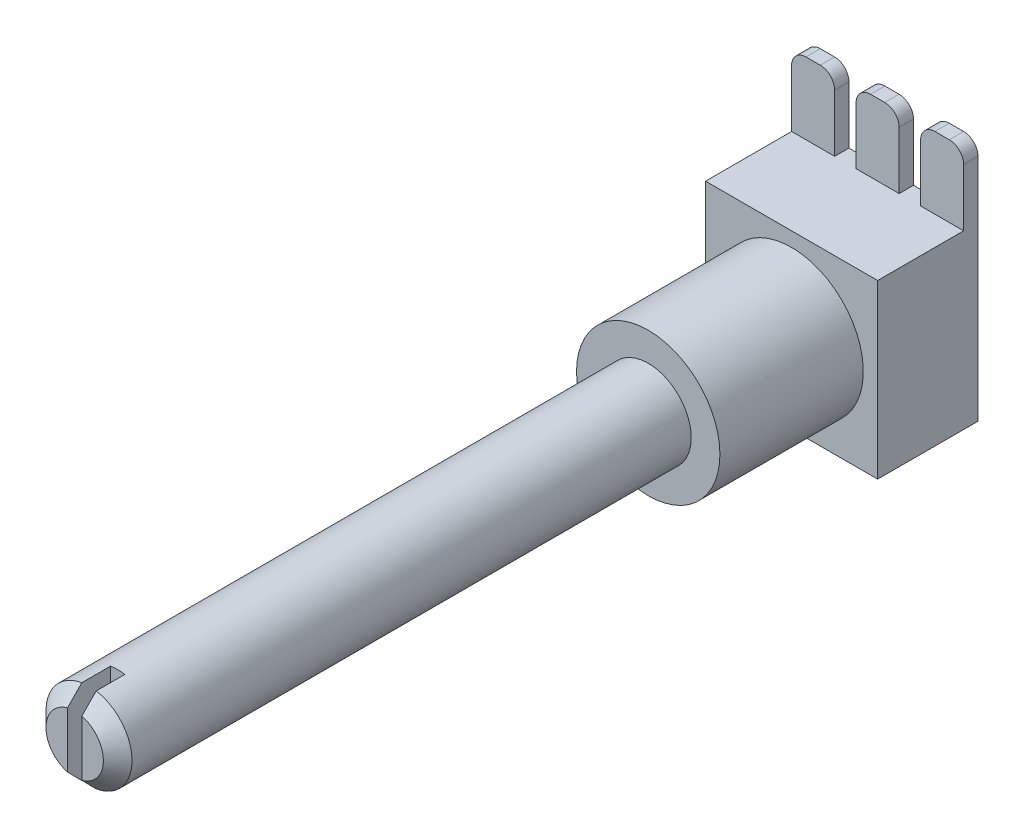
ISO-10303-21;
HEADER;
FILE_DESCRIPTION(('STEP AP214'),'2;1');
FILE_NAME('part.step','',(''),(''),'','','');
FILE_SCHEMA(('AUTOMOTIVE_DESIGN { 1 0 10303 214 1 1 1 1 }'));
ENDSEC;
DATA;
#1=APPLICATION_CONTEXT('core data for automotive mechanical design processes');
#2=APPLICATION_PROTOCOL_DEFINITION('international standard','automotive_design',2000,#1);
#3=PRODUCT_CONTEXT('',#1,'mechanical');
#4=PRODUCT('Part','Part','',(#3));
#5=PRODUCT_RELATED_PRODUCT_CATEGORY('part','',(#4));
#6=PRODUCT_DEFINITION_FORMATION('','',#4);
#7=PRODUCT_DEFINITION_CONTEXT('part definition',#1,'design');
#8=PRODUCT_DEFINITION('design','',#6,#7);
#9=PRODUCT_DEFINITION_SHAPE('','',#8);
#10=(LENGTH_UNIT() NAMED_UNIT(*) SI_UNIT(.MILLI.,.METRE.));
#11=(NAMED_UNIT(*) PLANE_ANGLE_UNIT() SI_UNIT($,.RADIAN.));
#12=(NAMED_UNIT(*) SI_UNIT($,.STERADIAN.) SOLID_ANGLE_UNIT());
#13=UNCERTAINTY_MEASURE_WITH_UNIT(LENGTH_MEASURE(1.E-05),#10,'distance_accuracy_value','');
#14=(GEOMETRIC_REPRESENTATION_CONTEXT(3) GLOBAL_UNCERTAINTY_ASSIGNED_CONTEXT((#13)) GLOBAL_UNIT_ASSIGNED_CONTEXT((#10,
#11,#12)) REPRESENTATION_CONTEXT('',''));
#15=CARTESIAN_POINT('',(0.,0.,0.));
#16=DIRECTION('',(0.,0.,1.));
#17=DIRECTION('',(1.,0.,0.));
#18=AXIS2_PLACEMENT_3D('',#15,#16,#17);
#19=CARTESIAN_POINT('',(0.,6.,57.));
#20=DIRECTION('',(0.,0.,1.));
#21=DIRECTION('',(1.,0.,0.));
#22=AXIS2_PLACEMENT_3D('',#19,#20,#21);
#23=PLANE('',#22);
#24=DIRECTION('',(0.,-1.,0.));
#25=VECTOR('',#24,1.);
#26=CARTESIAN_POINT('',(-0.500000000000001,10.318181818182,57.));
#27=LINE('',#26,#25);
#28=CARTESIAN_POINT('',(-0.5,7.93649167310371,57.));
#29=VERTEX_POINT('',#28);
#30=CARTESIAN_POINT('',(-0.5,4.06350832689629,57.));
#31=VERTEX_POINT('',#30);
#32=EDGE_CURVE('E208',#29,#31,#27,.T.);
#33=ORIENTED_EDGE('',*,*,#32,.F.);
#34=CARTESIAN_POINT('',(0.,6.,57.));
#35=DIRECTION('',(0.,0.,1.));
#36=DIRECTION('',(1.,0.,0.));
#37=AXIS2_PLACEMENT_3D('',#34,#35,#36);
#38=CIRCLE('',#37,2.);
#39=EDGE_CURVE('E221',#29,#31,#38,.T.);
#40=ORIENTED_EDGE('',*,*,#39,.T.);
#41=EDGE_LOOP('',(#33,#40));
#42=FACE_BOUND('',#41,.T.);
#43=ADVANCED_FACE('F33',(#42),#23,.T.);
#44=CARTESIAN_POINT('',(0.,6.,57.));
#45=DIRECTION('',(0.,0.,-1.));
#46=DIRECTION('',(-1.,0.,0.));
#47=AXIS2_PLACEMENT_3D('',#44,#45,#46);
#48=CONICAL_SURFACE('',#47,2.,0.785398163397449);
#49=CARTESIAN_POINT('',(-0.5,5.72789823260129,58.4307554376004));
#50=CARTESIAN_POINT('',(-0.5,5.70588010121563,58.4202095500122));
#51=CARTESIAN_POINT('',(-0.5,5.68424952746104,58.4089052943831));
#52=CARTESIAN_POINT('',(-0.5,5.64167552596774,58.3851191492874));
#53=CARTESIAN_POINT('',(-0.5,5.62073132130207,58.372638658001));
#54=CARTESIAN_POINT('',(-0.5,5.57945869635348,58.3468551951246));
#55=CARTESIAN_POINT('',(-0.5,5.55912848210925,58.3335550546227));
#56=CARTESIAN_POINT('',(-0.5,5.51890895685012,58.3062923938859));
#57=CARTESIAN_POINT('',(-0.5,5.4990197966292,58.2923296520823));
#58=CARTESIAN_POINT('',(-0.5,5.44004866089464,58.2497995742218));
#59=CARTESIAN_POINT('',(-0.5,5.40150496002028,58.2204881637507));
#60=CARTESIAN_POINT('',(-0.5,5.32535999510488,58.160600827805));
#61=CARTESIAN_POINT('',(-0.5,5.28775978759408,58.1300235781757));
#62=CARTESIAN_POINT('',(-0.5,5.21124645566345,58.0663741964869));
#63=CARTESIAN_POINT('',(-0.5,5.17237149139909,58.0332563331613));
#64=CARTESIAN_POINT('',(-0.5,5.09516775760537,57.9663886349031));
#65=CARTESIAN_POINT('',(-0.5,5.05683901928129,57.9326387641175));
#66=CARTESIAN_POINT('',(-0.5,4.94243385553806,57.8307132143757));
#67=CARTESIAN_POINT('',(-0.5,4.86695115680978,57.7618723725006));
#68=CARTESIAN_POINT('',(-0.5,4.71689717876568,57.6232110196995));
#69=CARTESIAN_POINT('',(-0.5,4.64232590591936,57.5533905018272));
#70=CARTESIAN_POINT('',(-0.5,4.49377287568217,57.4131411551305));
#71=CARTESIAN_POINT('',(-0.5,4.41979105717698,57.3427123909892));
#72=CARTESIAN_POINT('',(-0.5,4.2717266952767,57.2009810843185));
#73=CARTESIAN_POINT('',(-0.5,4.19764673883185,57.1296758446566));
#74=CARTESIAN_POINT('',(-0.5,4.04976206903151,56.9867767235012));
#75=CARTESIAN_POINT('',(-0.5,3.97595736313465,56.915182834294));
#76=CARTESIAN_POINT('',(-0.5,3.75486535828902,56.7001199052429));
#77=CARTESIAN_POINT('',(-0.5,3.60787519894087,56.5563455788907));
#78=CARTESIAN_POINT('',(-0.5,3.27994318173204,56.2345890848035));
#79=CARTESIAN_POINT('',(-0.5,3.09911864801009,56.0564875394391));
#80=CARTESIAN_POINT('',(-0.5,2.73784962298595,55.6998788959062));
#81=CARTESIAN_POINT('',(-0.5,2.55740515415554,55.5213717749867));
#82=CARTESIAN_POINT('',(-0.5,2.19842798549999,55.1657660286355));
#83=CARTESIAN_POINT('',(-0.5,2.01989304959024,54.9886696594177));
#84=CARTESIAN_POINT('',(-0.5,1.66299941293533,54.6343214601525));
#85=CARTESIAN_POINT('',(-0.5,1.48464070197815,54.457069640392));
#86=CARTESIAN_POINT('',(-0.5,1.30632807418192,54.279771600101));
#87=B_SPLINE_CURVE_WITH_KNOTS('',3,(#49,#50,#51,#52,#53,#54,#55,#56,#57,#58,#59,#60,#61,#62,#63,
#64,#65,#66,#67,#68,#69,#70,#71,#72,#73,#74,#75,#76,#77,#78,#79,#80,#81,#82,#83,#84,#85,#86),
.UNSPECIFIED.,.F.,.F.,(4,2,2,2,2,2,2,2,2,2,2,2,2,2,2,2,2,2,4),(0.,0.0731938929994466,
0.146301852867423,0.219170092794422,0.292062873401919,0.437284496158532,0.582662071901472,
0.73585902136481,0.889064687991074,1.19552591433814,1.50198931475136,1.80842051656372,
2.11688431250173,2.42535640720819,3.04219663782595,3.80361484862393,4.56507688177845,
5.31949085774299,6.07385819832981),.UNSPECIFIED.);
#88=CARTESIAN_POINT('',(-0.5,3.04196010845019,56.));
#89=VERTEX_POINT('',#88);
#90=EDGE_CURVE('E224',#31,#89,#87,.T.);
#91=ORIENTED_EDGE('',*,*,#90,.F.);
#92=ORIENTED_EDGE('',*,*,#39,.F.);
#93=CARTESIAN_POINT('',(-0.500000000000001,9.99895730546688,54.9699057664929));
#94=CARTESIAN_POINT('',(-0.500000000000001,9.84567714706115,55.121987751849));
#95=CARTESIAN_POINT('',(-0.500000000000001,9.69234258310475,55.2740151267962));
#96=CARTESIAN_POINT('',(-0.500000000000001,9.38548319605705,55.577864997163));
#97=CARTESIAN_POINT('',(-0.500000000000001,9.23195838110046,55.7296875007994));
#98=CARTESIAN_POINT('',(-0.500000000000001,8.92466179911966,56.0330076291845));
#99=CARTESIAN_POINT('',(-0.500000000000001,8.77089010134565,56.1845053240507));
#100=CARTESIAN_POINT('',(-0.500000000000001,8.46288397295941,56.4870435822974));
#101=CARTESIAN_POINT('',(-0.500000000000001,8.30864952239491,56.6380841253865));
#102=CARTESIAN_POINT('',(-0.500000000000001,8.0369745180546,56.902725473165));
#103=CARTESIAN_POINT('',(-0.5,7.91970475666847,57.0165012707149));
#104=CARTESIAN_POINT('',(-0.5,7.74322346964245,57.1865543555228));
#105=CARTESIAN_POINT('',(-0.5,7.68430342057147,57.2431339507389));
#106=CARTESIAN_POINT('',(-0.5,7.56619827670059,57.356018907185));
#107=CARTESIAN_POINT('',(-0.5,7.50701317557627,57.4123242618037));
#108=CARTESIAN_POINT('',(-0.5,7.38825988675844,57.5245717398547));
#109=CARTESIAN_POINT('',(-0.5,7.32869157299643,57.5805137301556));
#110=CARTESIAN_POINT('',(-0.5,7.20903893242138,57.6918359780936));
#111=CARTESIAN_POINT('',(-0.5,7.14895463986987,57.7472162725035));
#112=CARTESIAN_POINT('',(-0.5,7.02798787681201,57.8571462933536));
#113=CARTESIAN_POINT('',(-0.5,6.96710513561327,57.9116957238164));
#114=CARTESIAN_POINT('',(-0.5,6.87484206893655,57.9924640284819));
#115=CARTESIAN_POINT('',(-0.5,6.84392773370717,58.0192137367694));
#116=CARTESIAN_POINT('',(-0.5,6.78168014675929,58.0722263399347));
#117=CARTESIAN_POINT('',(-0.5,6.75034685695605,58.0984891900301));
#118=CARTESIAN_POINT('',(-0.5,6.71875286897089,58.1244397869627));
#119=B_SPLINE_CURVE_WITH_KNOTS('',3,(#93,#94,#95,#96,#97,#98,#99,#100,#101,#102,#103,#104,#105,
#106,#107,#108,#109,#110,#111,#112,#113,#114,#115,#116,#117,#118),.UNSPECIFIED.,.F.,.F.,(4,2,2,
2,2,2,2,2,2,2,2,2,4),(0.,0.647776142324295,1.295525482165,1.94311706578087,2.59073698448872,
3.08091200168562,3.32597340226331,3.57104068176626,3.81619318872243,4.06132954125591,
4.30655126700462,4.42918938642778,4.5518387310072),.UNSPECIFIED.);
#120=CARTESIAN_POINT('',(-0.500000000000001,8.95803989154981,56.));
#121=VERTEX_POINT('',#120);
#122=EDGE_CURVE('E204',#121,#29,#119,.T.);
#123=ORIENTED_EDGE('',*,*,#122,.F.);
#124=CARTESIAN_POINT('',(0.,6.,56.));
#125=DIRECTION('',(0.,0.,1.));
#126=DIRECTION('',(1.,0.,0.));
#127=AXIS2_PLACEMENT_3D('',#124,#125,#126);
#128=CIRCLE('',#127,3.);
#129=EDGE_CURVE('E229',#89,#121,#128,.F.);
#130=ORIENTED_EDGE('',*,*,#129,.F.);
#131=EDGE_LOOP('',(#91,#92,#123,#130));
#132=FACE_BOUND('',#131,.T.);
#133=ADVANCED_FACE('F223',(#132),#48,.T.);
#134=CARTESIAN_POINT('',(-6.,12.,7.));
#135=DIRECTION('',(0.,1.,0.));
#136=DIRECTION('',(-1.,0.,0.));
#137=AXIS2_PLACEMENT_3D('',#134,#135,#136);
#138=PLANE('',#137);
#139=DIRECTION('',(1.,0.,0.));
#140=VECTOR('',#139,1.);
#141=CARTESIAN_POINT('',(-6.,12.,0.));
#142=LINE('',#141,#140);
#143=CARTESIAN_POINT('',(-3.00000000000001,12.,0.));
#144=VERTEX_POINT('',#143);
#145=CARTESIAN_POINT('',(-1.49999999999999,12.,0.));
#146=VERTEX_POINT('',#145);
#147=EDGE_CURVE('E234',#144,#146,#142,.T.);
#148=ORIENTED_EDGE('',*,*,#147,.F.);
#149=DIRECTION('',(0.,0.,-1.));
#150=VECTOR('',#149,1.);
#151=CARTESIAN_POINT('',(-3.00000000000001,12.,1.));
#152=LINE('',#151,#150);
#153=CARTESIAN_POINT('',(-3.00000000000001,12.,1.));
#154=VERTEX_POINT('',#153);
#155=EDGE_CURVE('E315',#154,#144,#152,.T.);
#156=ORIENTED_EDGE('',*,*,#155,.F.);
#157=DIRECTION('',(-1.,0.,0.));
#158=VECTOR('',#157,1.);
#159=CARTESIAN_POINT('',(-3.00000000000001,12.,1.));
#160=LINE('',#159,#158);
#161=CARTESIAN_POINT('',(-6.,12.,1.));
#162=VERTEX_POINT('',#161);
#163=EDGE_CURVE('E312',#154,#162,#160,.T.);
#164=ORIENTED_EDGE('',*,*,#163,.T.);
#165=DIRECTION('',(0.,0.,-1.));
#166=VECTOR('',#165,1.);
#167=CARTESIAN_POINT('',(-6.,12.,7.));
#168=LINE('',#167,#166);
#169=CARTESIAN_POINT('',(-6.,12.,7.));
#170=VERTEX_POINT('',#169);
#171=EDGE_CURVE('E429',#170,#162,#168,.T.);
#172=ORIENTED_EDGE('',*,*,#171,.F.);
#173=DIRECTION('',(1.,0.,0.));
#174=VECTOR('',#173,1.);
#175=CARTESIAN_POINT('',(-6.,12.,7.));
#176=LINE('',#175,#174);
#177=CARTESIAN_POINT('',(6.,12.,7.));
#178=VERTEX_POINT('',#177);
#179=EDGE_CURVE('E426',#170,#178,#176,.T.);
#180=ORIENTED_EDGE('',*,*,#179,.T.);
#181=DIRECTION('',(0.,0.,-1.));
#182=VECTOR('',#181,1.);
#183=CARTESIAN_POINT('',(6.,12.,7.));
#184=LINE('',#183,#182);
#185=CARTESIAN_POINT('',(6.,12.,1.));
#186=VERTEX_POINT('',#185);
#187=EDGE_CURVE('E432',#178,#186,#184,.T.);
#188=ORIENTED_EDGE('',*,*,#187,.T.);
#189=DIRECTION('',(-1.,0.,0.));
#190=VECTOR('',#189,1.);
#191=CARTESIAN_POINT('',(6.,12.,1.));
#192=LINE('',#191,#190);
#193=CARTESIAN_POINT('',(3.,12.,1.));
#194=VERTEX_POINT('',#193);
#195=EDGE_CURVE('E393',#186,#194,#192,.T.);
#196=ORIENTED_EDGE('',*,*,#195,.T.);
#197=DIRECTION('',(0.,0.,-1.));
#198=VECTOR('',#197,1.);
#199=CARTESIAN_POINT('',(3.,12.,1.));
#200=LINE('',#199,#198);
#201=CARTESIAN_POINT('',(3.,12.,0.));
#202=VERTEX_POINT('',#201);
#203=EDGE_CURVE('E399',#194,#202,#200,.T.);
#204=ORIENTED_EDGE('',*,*,#203,.T.);
#205=CARTESIAN_POINT('',(1.5,12.,0.));
#206=VERTEX_POINT('',#205);
#207=EDGE_CURVE('E412',#206,#202,#142,.T.);
#208=ORIENTED_EDGE('',*,*,#207,.F.);
#209=DIRECTION('',(0.,0.,-1.));
#210=VECTOR('',#209,1.);
#211=CARTESIAN_POINT('',(1.5,12.,1.));
#212=LINE('',#211,#210);
#213=CARTESIAN_POINT('',(1.5,12.,1.));
#214=VERTEX_POINT('',#213);
#215=EDGE_CURVE('E369',#214,#206,#212,.T.);
#216=ORIENTED_EDGE('',*,*,#215,.F.);
#217=DIRECTION('',(1.,0.,0.));
#218=VECTOR('',#217,1.);
#219=CARTESIAN_POINT('',(-1.49999999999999,12.,1.));
#220=LINE('',#219,#218);
#221=CARTESIAN_POINT('',(-1.49999999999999,12.,1.));
#222=VERTEX_POINT('',#221);
#223=EDGE_CURVE('E341',#222,#214,#220,.T.);
#224=ORIENTED_EDGE('',*,*,#223,.F.);
#225=DIRECTION('',(0.,0.,-1.));
#226=VECTOR('',#225,1.);
#227=CARTESIAN_POINT('',(-1.49999999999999,12.,1.));
#228=LINE('',#227,#226);
#229=EDGE_CURVE('E357',#222,#146,#228,.T.);
#230=ORIENTED_EDGE('',*,*,#229,.T.);
#231=EDGE_LOOP('',(#148,#156,#164,#172,#180,#188,#196,#204,#208,#216,#224,#230));
#232=FACE_BOUND('',#231,.T.);
#233=ADVANCED_FACE('F449',(#232),#138,.T.);
#234=CARTESIAN_POINT('',(0.,6.,17.));
#235=DIRECTION('',(0.,0.,1.));
#236=DIRECTION('',(1.,0.,0.));
#237=AXIS2_PLACEMENT_3D('',#234,#235,#236);
#238=PLANE('',#237);
#239=CARTESIAN_POINT('',(0.,6.,17.));
#240=DIRECTION('',(0.,0.,1.));
#241=DIRECTION('',(1.,0.,0.));
#242=AXIS2_PLACEMENT_3D('',#239,#240,#241);
#243=CIRCLE('',#242,5.);
#244=CARTESIAN_POINT('',(5.,6.,17.));
#245=VERTEX_POINT('',#244);
#246=EDGE_CURVE('E471',#245,#245,#243,.T.);
#247=ORIENTED_EDGE('',*,*,#246,.T.);
#248=EDGE_LOOP('',(#247));
#249=FACE_BOUND('',#248,.T.);
#250=CARTESIAN_POINT('',(0.,6.,17.));
#251=DIRECTION('',(0.,0.,1.));
#252=DIRECTION('',(1.,0.,0.));
#253=AXIS2_PLACEMENT_3D('',#250,#251,#252);
#254=CIRCLE('',#253,3.);
#255=CARTESIAN_POINT('',(3.,6.,17.));
#256=VERTEX_POINT('',#255);
#257=EDGE_CURVE('E468',#256,#256,#254,.T.);
#258=ORIENTED_EDGE('',*,*,#257,.F.);
#259=EDGE_LOOP('',(#258));
#260=FACE_BOUND('',#259,.T.);
#261=ADVANCED_FACE('F675',(#249,#260),#238,.T.);
#262=CARTESIAN_POINT('',(-6.,0.,7.));
#263=DIRECTION('',(0.,0.,-1.));
#264=DIRECTION('',(-1.,0.,0.));
#265=AXIS2_PLACEMENT_3D('',#262,#263,#264);
#266=PLANE('',#265);
#267=DIRECTION('',(0.,-1.,0.));
#268=VECTOR('',#267,1.);
#269=CARTESIAN_POINT('',(-6.,12.,7.));
#270=LINE('',#269,#268);
#271=CARTESIAN_POINT('',(-6.,0.,7.));
#272=VERTEX_POINT('',#271);
#273=EDGE_CURVE('E418',#170,#272,#270,.T.);
#274=ORIENTED_EDGE('',*,*,#273,.T.);
#275=DIRECTION('',(-1.,0.,0.));
#276=VECTOR('',#275,1.);
#277=CARTESIAN_POINT('',(6.,0.,7.));
#278=LINE('',#277,#276);
#279=CARTESIAN_POINT('',(6.,0.,7.));
#280=VERTEX_POINT('',#279);
#281=EDGE_CURVE('E421',#280,#272,#278,.T.);
#282=ORIENTED_EDGE('',*,*,#281,.F.);
#283=DIRECTION('',(0.,1.,0.));
#284=VECTOR('',#283,1.);
#285=CARTESIAN_POINT('',(6.,0.,7.));
#286=LINE('',#285,#284);
#287=EDGE_CURVE('E424',#280,#178,#286,.T.);
#288=ORIENTED_EDGE('',*,*,#287,.T.);
#289=ORIENTED_EDGE('',*,*,#179,.F.);
#290=EDGE_LOOP('',(#274,#282,#288,#289));
#291=FACE_BOUND('',#290,.T.);
#292=CARTESIAN_POINT('',(0.,6.,7.));
#293=DIRECTION('',(0.,0.,-1.));
#294=DIRECTION('',(-1.,0.,0.));
#295=AXIS2_PLACEMENT_3D('',#292,#293,#294);
#296=CIRCLE('',#295,5.);
#297=CARTESIAN_POINT('',(-5.,6.,7.));
#298=VERTEX_POINT('',#297);
#299=EDGE_CURVE('E232',#298,#298,#296,.F.);
#300=ORIENTED_EDGE('',*,*,#299,.F.);
#301=EDGE_LOOP('',(#300));
#302=FACE_BOUND('',#301,.T.);
#303=ADVANCED_FACE('F687',(#291,#302),#266,.F.);
#304=CARTESIAN_POINT('',(-6.,12.,7.));
#305=DIRECTION('',(1.,0.,0.));
#306=DIRECTION('',(0.,1.,0.));
#307=AXIS2_PLACEMENT_3D('',#304,#305,#306);
#308=PLANE('',#307);
#309=DIRECTION('',(0.,-1.,0.));
#310=VECTOR('',#309,1.);
#311=CARTESIAN_POINT('',(-6.,12.,0.));
#312=LINE('',#311,#310);
#313=CARTESIAN_POINT('',(-6.,16.,0.));
#314=VERTEX_POINT('',#313);
#315=CARTESIAN_POINT('',(-6.,0.,0.));
#316=VERTEX_POINT('',#315);
#317=EDGE_CURVE('E474',#314,#316,#312,.T.);
#318=ORIENTED_EDGE('',*,*,#317,.T.);
#319=DIRECTION('',(0.,0.,-1.));
#320=VECTOR('',#319,1.);
#321=CARTESIAN_POINT('',(-6.,0.,7.));
#322=LINE('',#321,#320);
#323=EDGE_CURVE('E803',#272,#316,#322,.T.);
#324=ORIENTED_EDGE('',*,*,#323,.F.);
#325=ORIENTED_EDGE('',*,*,#273,.F.);
#326=ORIENTED_EDGE('',*,*,#171,.T.);
#327=DIRECTION('',(0.,-1.,0.));
#328=VECTOR('',#327,1.);
#329=CARTESIAN_POINT('',(-6.,16.,1.));
#330=LINE('',#329,#328);
#331=CARTESIAN_POINT('',(-6.,16.,1.));
#332=VERTEX_POINT('',#331);
#333=EDGE_CURVE('E310',#332,#162,#330,.T.);
#334=ORIENTED_EDGE('',*,*,#333,.F.);
#335=DIRECTION('',(0.,0.,-1.));
#336=VECTOR('',#335,1.);
#337=CARTESIAN_POINT('',(-6.,16.,1.));
#338=LINE('',#337,#336);
#339=EDGE_CURVE('E317',#332,#314,#338,.T.);
#340=ORIENTED_EDGE('',*,*,#339,.T.);
#341=EDGE_LOOP('',(#318,#324,#325,#326,#334,#340));
#342=FACE_BOUND('',#341,.T.);
#343=ADVANCED_FACE('F35',(#342),#308,.F.);
#344=CARTESIAN_POINT('',(6.,0.,7.));
#345=DIRECTION('',(0.,-1.,0.));
#346=DIRECTION('',(1.,0.,0.));
#347=AXIS2_PLACEMENT_3D('',#344,#345,#346);
#348=PLANE('',#347);
#349=DIRECTION('',(-1.,0.,0.));
#350=VECTOR('',#349,1.);
#351=CARTESIAN_POINT('',(6.,0.,0.));
#352=LINE('',#351,#350);
#353=CARTESIAN_POINT('',(6.,0.,0.));
#354=VERTEX_POINT('',#353);
#355=EDGE_CURVE('E476',#354,#316,#352,.T.);
#356=ORIENTED_EDGE('',*,*,#355,.F.);
#357=DIRECTION('',(0.,0.,-1.));
#358=VECTOR('',#357,1.);
#359=CARTESIAN_POINT('',(6.,0.,7.));
#360=LINE('',#359,#358);
#361=EDGE_CURVE('E435',#280,#354,#360,.T.);
#362=ORIENTED_EDGE('',*,*,#361,.F.);
#363=ORIENTED_EDGE('',*,*,#281,.T.);
#364=ORIENTED_EDGE('',*,*,#323,.T.);
#365=EDGE_LOOP('',(#356,#362,#363,#364));
#366=FACE_BOUND('',#365,.T.);
#367=ADVANCED_FACE('F686',(#366),#348,.T.);
#368=CARTESIAN_POINT('',(6.,0.,7.));
#369=DIRECTION('',(-1.,0.,0.));
#370=DIRECTION('',(0.,0.,1.));
#371=AXIS2_PLACEMENT_3D('',#368,#369,#370);
#372=PLANE('',#371);
#373=DIRECTION('',(0.,1.,0.));
#374=VECTOR('',#373,1.);
#375=CARTESIAN_POINT('',(6.,0.,0.));
#376=LINE('',#375,#374);
#377=CARTESIAN_POINT('',(6.,16.,0.));
#378=VERTEX_POINT('',#377);
#379=EDGE_CURVE('E413',#354,#378,#376,.T.);
#380=ORIENTED_EDGE('',*,*,#379,.T.);
#381=DIRECTION('',(0.,0.,-1.));
#382=VECTOR('',#381,1.);
#383=CARTESIAN_POINT('',(6.,16.,1.));
#384=LINE('',#383,#382);
#385=CARTESIAN_POINT('',(6.,16.,1.));
#386=VERTEX_POINT('',#385);
#387=EDGE_CURVE('E463',#386,#378,#384,.T.);
#388=ORIENTED_EDGE('',*,*,#387,.F.);
#389=DIRECTION('',(0.,1.,0.));
#390=VECTOR('',#389,1.);
#391=CARTESIAN_POINT('',(6.,12.,1.));
#392=LINE('',#391,#390);
#393=EDGE_CURVE('E385',#186,#386,#392,.T.);
#394=ORIENTED_EDGE('',*,*,#393,.F.);
#395=ORIENTED_EDGE('',*,*,#187,.F.);
#396=ORIENTED_EDGE('',*,*,#287,.F.);
#397=ORIENTED_EDGE('',*,*,#361,.T.);
#398=EDGE_LOOP('',(#380,#388,#394,#395,#396,#397));
#399=FACE_BOUND('',#398,.T.);
#400=ADVANCED_FACE('F482',(#399),#372,.F.);
#401=CARTESIAN_POINT('',(-6.,0.,0.));
#402=DIRECTION('',(0.,0.,-1.));
#403=DIRECTION('',(-1.,0.,0.));
#404=AXIS2_PLACEMENT_3D('',#401,#402,#403);
#405=PLANE('',#404);
#406=ORIENTED_EDGE('',*,*,#317,.F.);
#407=CARTESIAN_POINT('',(-5.,16.,0.));
#408=DIRECTION('',(0.,0.,-1.));
#409=DIRECTION('',(-1.,0.,0.));
#410=AXIS2_PLACEMENT_3D('',#407,#408,#409);
#411=CIRCLE('',#410,1.);
#412=CARTESIAN_POINT('',(-5.00000000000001,17.,0.));
#413=VERTEX_POINT('',#412);
#414=EDGE_CURVE('E296',#314,#413,#411,.T.);
#415=ORIENTED_EDGE('',*,*,#414,.T.);
#416=DIRECTION('',(1.,0.,0.));
#417=VECTOR('',#416,1.);
#418=CARTESIAN_POINT('',(-5.00000000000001,17.,0.));
#419=LINE('',#418,#417);
#420=CARTESIAN_POINT('',(-4.00000000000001,17.,0.));
#421=VERTEX_POINT('',#420);
#422=EDGE_CURVE('E293',#413,#421,#419,.T.);
#423=ORIENTED_EDGE('',*,*,#422,.T.);
#424=CARTESIAN_POINT('',(-4.00000000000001,16.,0.));
#425=DIRECTION('',(0.,0.,1.));
#426=DIRECTION('',(1.,0.,0.));
#427=AXIS2_PLACEMENT_3D('',#424,#425,#426);
#428=CIRCLE('',#427,1.);
#429=CARTESIAN_POINT('',(-3.00000000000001,16.,0.));
#430=VERTEX_POINT('',#429);
#431=EDGE_CURVE('E290',#430,#421,#428,.T.);
#432=ORIENTED_EDGE('',*,*,#431,.F.);
#433=DIRECTION('',(0.,1.,0.));
#434=VECTOR('',#433,1.);
#435=CARTESIAN_POINT('',(-3.00000000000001,12.,0.));
#436=LINE('',#435,#434);
#437=EDGE_CURVE('E56',#144,#430,#436,.T.);
#438=ORIENTED_EDGE('',*,*,#437,.F.);
#439=ORIENTED_EDGE('',*,*,#147,.T.);
#440=DIRECTION('',(0.,-1.,0.));
#441=VECTOR('',#440,1.);
#442=CARTESIAN_POINT('',(-1.49999999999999,16.,0.));
#443=LINE('',#442,#441);
#444=CARTESIAN_POINT('',(-1.49999999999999,16.,0.));
#445=VERTEX_POINT('',#444);
#446=EDGE_CURVE('E338',#445,#146,#443,.T.);
#447=ORIENTED_EDGE('',*,*,#446,.F.);
#448=CARTESIAN_POINT('',(-0.499999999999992,16.,0.));
#449=DIRECTION('',(0.,0.,-1.));
#450=DIRECTION('',(-1.,0.,0.));
#451=AXIS2_PLACEMENT_3D('',#448,#449,#450);
#452=CIRCLE('',#451,1.);
#453=CARTESIAN_POINT('',(-0.499999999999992,17.,0.));
#454=VERTEX_POINT('',#453);
#455=EDGE_CURVE('E335',#445,#454,#452,.T.);
#456=ORIENTED_EDGE('',*,*,#455,.T.);
#457=DIRECTION('',(1.,0.,0.));
#458=VECTOR('',#457,1.);
#459=CARTESIAN_POINT('',(-0.499999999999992,17.,0.));
#460=LINE('',#459,#458);
#461=CARTESIAN_POINT('',(0.500000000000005,17.,0.));
#462=VERTEX_POINT('',#461);
#463=EDGE_CURVE('E332',#454,#462,#460,.T.);
#464=ORIENTED_EDGE('',*,*,#463,.T.);
#465=CARTESIAN_POINT('',(0.500000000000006,16.,0.));
#466=DIRECTION('',(0.,0.,1.));
#467=DIRECTION('',(1.,0.,0.));
#468=AXIS2_PLACEMENT_3D('',#465,#466,#467);
#469=CIRCLE('',#468,1.);
#470=CARTESIAN_POINT('',(1.50000000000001,16.,0.));
#471=VERTEX_POINT('',#470);
#472=EDGE_CURVE('E329',#471,#462,#469,.T.);
#473=ORIENTED_EDGE('',*,*,#472,.F.);
#474=DIRECTION('',(0.,1.,0.));
#475=VECTOR('',#474,1.);
#476=CARTESIAN_POINT('',(1.5,12.,0.));
#477=LINE('',#476,#475);
#478=EDGE_CURVE('E327',#206,#471,#477,.T.);
#479=ORIENTED_EDGE('',*,*,#478,.F.);
#480=ORIENTED_EDGE('',*,*,#207,.T.);
#481=DIRECTION('',(0.,-1.,0.));
#482=VECTOR('',#481,1.);
#483=CARTESIAN_POINT('',(3.00000000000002,16.,0.));
#484=LINE('',#483,#482);
#485=CARTESIAN_POINT('',(3.00000000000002,16.,0.));
#486=VERTEX_POINT('',#485);
#487=EDGE_CURVE('E381',#486,#202,#484,.T.);
#488=ORIENTED_EDGE('',*,*,#487,.F.);
#489=CARTESIAN_POINT('',(4.00000000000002,16.,0.));
#490=DIRECTION('',(0.,0.,-1.));
#491=DIRECTION('',(-1.,0.,0.));
#492=AXIS2_PLACEMENT_3D('',#489,#490,#491);
#493=CIRCLE('',#492,1.);
#494=CARTESIAN_POINT('',(4.00000000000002,17.,0.));
#495=VERTEX_POINT('',#494);
#496=EDGE_CURVE('E378',#486,#495,#493,.T.);
#497=ORIENTED_EDGE('',*,*,#496,.T.);
#498=DIRECTION('',(1.,0.,0.));
#499=VECTOR('',#498,1.);
#500=CARTESIAN_POINT('',(4.00000000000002,17.,0.));
#501=LINE('',#500,#499);
#502=CARTESIAN_POINT('',(5.,17.,0.));
#503=VERTEX_POINT('',#502);
#504=EDGE_CURVE('E375',#495,#503,#501,.T.);
#505=ORIENTED_EDGE('',*,*,#504,.T.);
#506=CARTESIAN_POINT('',(5.,16.,0.));
#507=DIRECTION('',(0.,0.,1.));
#508=DIRECTION('',(1.,0.,0.));
#509=AXIS2_PLACEMENT_3D('',#506,#507,#508);
#510=CIRCLE('',#509,1.);
#511=EDGE_CURVE('E372',#378,#503,#510,.T.);
#512=ORIENTED_EDGE('',*,*,#511,.F.);
#513=ORIENTED_EDGE('',*,*,#379,.F.);
#514=ORIENTED_EDGE('',*,*,#355,.T.);
#515=EDGE_LOOP('',(#406,#415,#423,#432,#438,#439,#447,#456,#464,#473,#479,#480,#488,#497,#505,
#512,#513,#514));
#516=FACE_BOUND('',#515,.T.);
#517=ADVANCED_FACE('F484',(#516),#405,.T.);
#518=CARTESIAN_POINT('',(0.,6.,17.));
#519=DIRECTION('',(0.,0.,-1.));
#520=DIRECTION('',(-1.,0.,0.));
#521=AXIS2_PLACEMENT_3D('',#518,#519,#520);
#522=CYLINDRICAL_SURFACE('',#521,5.);
#523=ORIENTED_EDGE('',*,*,#246,.F.);
#524=EDGE_LOOP('',(#523));
#525=FACE_BOUND('',#524,.T.);
#526=ORIENTED_EDGE('',*,*,#299,.T.);
#527=EDGE_LOOP('',(#526));
#528=FACE_BOUND('',#527,.T.);
#529=ADVANCED_FACE('F510',(#525,#528),#522,.T.);
#530=CARTESIAN_POINT('',(0.,6.,57.));
#531=DIRECTION('',(0.,0.,-1.));
#532=DIRECTION('',(-1.,0.,0.));
#533=AXIS2_PLACEMENT_3D('',#530,#531,#532);
#534=CYLINDRICAL_SURFACE('',#533,3.);
#535=ORIENTED_EDGE('',*,*,#129,.T.);
#536=DIRECTION('',(0.,0.,-1.));
#537=VECTOR('',#536,1.);
#538=CARTESIAN_POINT('',(-0.500000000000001,8.95803989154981,57.));
#539=LINE('',#538,#537);
#540=CARTESIAN_POINT('',(-0.500000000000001,8.95803989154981,54.));
#541=VERTEX_POINT('',#540);
#542=EDGE_CURVE('E211',#121,#541,#539,.T.);
#543=ORIENTED_EDGE('',*,*,#542,.T.);
#544=CARTESIAN_POINT('',(0.,6.,54.));
#545=DIRECTION('',(0.,0.,1.));
#546=DIRECTION('',(1.,0.,0.));
#547=AXIS2_PLACEMENT_3D('',#544,#545,#546);
#548=CIRCLE('',#547,3.);
#549=CARTESIAN_POINT('',(0.5,8.95803989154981,54.));
#550=VERTEX_POINT('',#549);
#551=EDGE_CURVE('E11',#550,#541,#548,.T.);
#552=ORIENTED_EDGE('',*,*,#551,.F.);
#553=DIRECTION('',(0.,0.,-1.));
#554=VECTOR('',#553,1.);
#555=CARTESIAN_POINT('',(0.5,8.95803989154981,57.));
#556=LINE('',#555,#554);
#557=CARTESIAN_POINT('',(0.5,8.95803989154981,56.));
#558=VERTEX_POINT('',#557);
#559=EDGE_CURVE('E278',#550,#558,#556,.F.);
#560=ORIENTED_EDGE('',*,*,#559,.T.);
#561=CARTESIAN_POINT('',(0.5,3.04196010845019,56.));
#562=VERTEX_POINT('',#561);
#563=EDGE_CURVE('E225',#558,#562,#128,.F.);
#564=ORIENTED_EDGE('',*,*,#563,.T.);
#565=DIRECTION('',(0.,0.,-1.));
#566=VECTOR('',#565,1.);
#567=CARTESIAN_POINT('',(0.5,3.04196010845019,57.));
#568=LINE('',#567,#566);
#569=CARTESIAN_POINT('',(0.5,3.04196010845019,54.));
#570=VERTEX_POINT('',#569);
#571=EDGE_CURVE('E275',#562,#570,#568,.T.);
#572=ORIENTED_EDGE('',*,*,#571,.T.);
#573=CARTESIAN_POINT('',(-0.5,3.04196010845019,54.));
#574=VERTEX_POINT('',#573);
#575=EDGE_CURVE('E37',#574,#570,#548,.T.);
#576=ORIENTED_EDGE('',*,*,#575,.F.);
#577=DIRECTION('',(0.,0.,-1.));
#578=VECTOR('',#577,1.);
#579=CARTESIAN_POINT('',(-0.5,3.04196010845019,57.));
#580=LINE('',#579,#578);
#581=EDGE_CURVE('E284',#574,#89,#580,.F.);
#582=ORIENTED_EDGE('',*,*,#581,.T.);
#583=EDGE_LOOP('',(#535,#543,#552,#560,#564,#572,#576,#582));
#584=FACE_BOUND('',#583,.T.);
#585=ORIENTED_EDGE('',*,*,#257,.T.);
#586=EDGE_LOOP('',(#585));
#587=FACE_BOUND('',#586,.T.);
#588=ADVANCED_FACE('F280',(#584,#587),#534,.T.);
#589=DIRECTION('',(0.,1.,0.));
#590=VECTOR('',#589,1.);
#591=CARTESIAN_POINT('',(0.5,10.318181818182,57.));
#592=LINE('',#591,#590);
#593=CARTESIAN_POINT('',(0.5,4.06350832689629,57.));
#594=VERTEX_POINT('',#593);
#595=CARTESIAN_POINT('',(0.5,7.93649167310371,57.));
#596=VERTEX_POINT('',#595);
#597=EDGE_CURVE('E48',#594,#596,#592,.T.);
#598=ORIENTED_EDGE('',*,*,#597,.F.);
#599=EDGE_CURVE('E226',#594,#596,#38,.T.);
#600=ORIENTED_EDGE('',*,*,#599,.T.);
#601=EDGE_LOOP('',(#598,#600));
#602=FACE_BOUND('',#601,.T.);
#603=ADVANCED_FACE('F497',(#602),#23,.T.);
#604=CARTESIAN_POINT('',(5.,16.,1.));
#605=DIRECTION('',(0.,0.,-1.));
#606=DIRECTION('',(-1.,0.,0.));
#607=AXIS2_PLACEMENT_3D('',#604,#605,#606);
#608=CYLINDRICAL_SURFACE('',#607,1.);
#609=ORIENTED_EDGE('',*,*,#511,.T.);
#610=DIRECTION('',(0.,0.,-1.));
#611=VECTOR('',#610,1.);
#612=CARTESIAN_POINT('',(5.,17.,1.));
#613=LINE('',#612,#611);
#614=CARTESIAN_POINT('',(5.,17.,1.));
#615=VERTEX_POINT('',#614);
#616=EDGE_CURVE('E462',#615,#503,#613,.T.);
#617=ORIENTED_EDGE('',*,*,#616,.F.);
#618=CARTESIAN_POINT('',(5.,16.,1.));
#619=DIRECTION('',(0.,0.,1.));
#620=DIRECTION('',(1.,0.,0.));
#621=AXIS2_PLACEMENT_3D('',#618,#619,#620);
#622=CIRCLE('',#621,1.);
#623=EDGE_CURVE('E382',#386,#615,#622,.T.);
#624=ORIENTED_EDGE('',*,*,#623,.F.);
#625=ORIENTED_EDGE('',*,*,#387,.T.);
#626=EDGE_LOOP('',(#609,#617,#624,#625));
#627=FACE_BOUND('',#626,.T.);
#628=ADVANCED_FACE('F487',(#627),#608,.T.);
#629=CARTESIAN_POINT('',(4.00000000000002,17.,1.));
#630=DIRECTION('',(0.,1.,0.));
#631=DIRECTION('',(0.,0.,1.));
#632=AXIS2_PLACEMENT_3D('',#629,#630,#631);
#633=PLANE('',#632);
#634=ORIENTED_EDGE('',*,*,#504,.F.);
#635=DIRECTION('',(0.,0.,-1.));
#636=VECTOR('',#635,1.);
#637=CARTESIAN_POINT('',(4.00000000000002,17.,1.));
#638=LINE('',#637,#636);
#639=CARTESIAN_POINT('',(4.00000000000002,17.,1.));
#640=VERTEX_POINT('',#639);
#641=EDGE_CURVE('E460',#640,#495,#638,.T.);
#642=ORIENTED_EDGE('',*,*,#641,.F.);
#643=DIRECTION('',(1.,0.,0.));
#644=VECTOR('',#643,1.);
#645=CARTESIAN_POINT('',(4.00000000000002,17.,1.));
#646=LINE('',#645,#644);
#647=EDGE_CURVE('E384',#640,#615,#646,.T.);
#648=ORIENTED_EDGE('',*,*,#647,.T.);
#649=ORIENTED_EDGE('',*,*,#616,.T.);
#650=EDGE_LOOP('',(#634,#642,#648,#649));
#651=FACE_BOUND('',#650,.T.);
#652=ADVANCED_FACE('F489',(#651),#633,.T.);
#653=CARTESIAN_POINT('',(4.00000000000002,16.,1.));
#654=DIRECTION('',(0.,0.,-1.));
#655=DIRECTION('',(-1.,0.,0.));
#656=AXIS2_PLACEMENT_3D('',#653,#654,#655);
#657=CYLINDRICAL_SURFACE('',#656,1.);
#658=ORIENTED_EDGE('',*,*,#496,.F.);
#659=DIRECTION('',(0.,0.,-1.));
#660=VECTOR('',#659,1.);
#661=CARTESIAN_POINT('',(3.00000000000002,16.,1.));
#662=LINE('',#661,#660);
#663=CARTESIAN_POINT('',(3.00000000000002,16.,1.));
#664=VERTEX_POINT('',#663);
#665=EDGE_CURVE('E396',#664,#486,#662,.T.);
#666=ORIENTED_EDGE('',*,*,#665,.F.);
#667=CARTESIAN_POINT('',(4.00000000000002,16.,1.));
#668=DIRECTION('',(0.,0.,-1.));
#669=DIRECTION('',(-1.,0.,0.));
#670=AXIS2_PLACEMENT_3D('',#667,#668,#669);
#671=CIRCLE('',#670,1.);
#672=EDGE_CURVE('E388',#664,#640,#671,.T.);
#673=ORIENTED_EDGE('',*,*,#672,.T.);
#674=ORIENTED_EDGE('',*,*,#641,.T.);
#675=EDGE_LOOP('',(#658,#666,#673,#674));
#676=FACE_BOUND('',#675,.T.);
#677=ADVANCED_FACE('F459',(#676),#657,.T.);
#678=CARTESIAN_POINT('',(3.00000000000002,16.,1.));
#679=DIRECTION('',(1.,0.,0.));
#680=DIRECTION('',(0.,1.,0.));
#681=AXIS2_PLACEMENT_3D('',#678,#679,#680);
#682=PLANE('',#681);
#683=ORIENTED_EDGE('',*,*,#487,.T.);
#684=ORIENTED_EDGE('',*,*,#203,.F.);
#685=DIRECTION('',(0.,-1.,0.));
#686=VECTOR('',#685,1.);
#687=CARTESIAN_POINT('',(3.00000000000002,16.,1.));
#688=LINE('',#687,#686);
#689=EDGE_CURVE('E391',#664,#194,#688,.T.);
#690=ORIENTED_EDGE('',*,*,#689,.F.);
#691=ORIENTED_EDGE('',*,*,#665,.T.);
#692=EDGE_LOOP('',(#683,#684,#690,#691));
#693=FACE_BOUND('',#692,.T.);
#694=ADVANCED_FACE('F444',(#693),#682,.F.);
#695=CARTESIAN_POINT('',(5.,16.,1.));
#696=DIRECTION('',(0.,0.,1.));
#697=DIRECTION('',(1.,0.,0.));
#698=AXIS2_PLACEMENT_3D('',#695,#696,#697);
#699=PLANE('',#698);
#700=ORIENTED_EDGE('',*,*,#393,.T.);
#701=ORIENTED_EDGE('',*,*,#623,.T.);
#702=ORIENTED_EDGE('',*,*,#647,.F.);
#703=ORIENTED_EDGE('',*,*,#672,.F.);
#704=ORIENTED_EDGE('',*,*,#689,.T.);
#705=ORIENTED_EDGE('',*,*,#195,.F.);
#706=EDGE_LOOP('',(#700,#701,#702,#703,#704,#705));
#707=FACE_BOUND('',#706,.T.);
#708=ADVANCED_FACE('F454',(#707),#699,.T.);
#709=CARTESIAN_POINT('',(1.5,12.,1.));
#710=DIRECTION('',(-1.,0.,0.));
#711=DIRECTION('',(0.,-1.,0.));
#712=AXIS2_PLACEMENT_3D('',#709,#710,#711);
#713=PLANE('',#712);
#714=ORIENTED_EDGE('',*,*,#478,.T.);
#715=DIRECTION('',(0.,0.,-1.));
#716=VECTOR('',#715,1.);
#717=CARTESIAN_POINT('',(1.50000000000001,16.,1.));
#718=LINE('',#717,#716);
#719=CARTESIAN_POINT('',(1.50000000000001,16.,1.));
#720=VERTEX_POINT('',#719);
#721=EDGE_CURVE('E366',#720,#471,#718,.T.);
#722=ORIENTED_EDGE('',*,*,#721,.F.);
#723=DIRECTION('',(0.,1.,0.));
#724=VECTOR('',#723,1.);
#725=CARTESIAN_POINT('',(1.5,12.,1.));
#726=LINE('',#725,#724);
#727=EDGE_CURVE('E344',#214,#720,#726,.T.);
#728=ORIENTED_EDGE('',*,*,#727,.F.);
#729=ORIENTED_EDGE('',*,*,#215,.T.);
#730=EDGE_LOOP('',(#714,#722,#728,#729));
#731=FACE_BOUND('',#730,.T.);
#732=ADVANCED_FACE('F560',(#731),#713,.F.);
#733=CARTESIAN_POINT('',(0.500000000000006,16.,1.));
#734=DIRECTION('',(0.,0.,-1.));
#735=DIRECTION('',(-1.,0.,0.));
#736=AXIS2_PLACEMENT_3D('',#733,#734,#735);
#737=CYLINDRICAL_SURFACE('',#736,1.);
#738=ORIENTED_EDGE('',*,*,#472,.T.);
#739=DIRECTION('',(0.,0.,-1.));
#740=VECTOR('',#739,1.);
#741=CARTESIAN_POINT('',(0.500000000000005,17.,1.));
#742=LINE('',#741,#740);
#743=CARTESIAN_POINT('',(0.500000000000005,17.,1.));
#744=VERTEX_POINT('',#743);
#745=EDGE_CURVE('E364',#744,#462,#742,.T.);
#746=ORIENTED_EDGE('',*,*,#745,.F.);
#747=CARTESIAN_POINT('',(0.500000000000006,16.,1.));
#748=DIRECTION('',(0.,0.,1.));
#749=DIRECTION('',(1.,0.,0.));
#750=AXIS2_PLACEMENT_3D('',#747,#748,#749);
#751=CIRCLE('',#750,1.);
#752=EDGE_CURVE('E346',#720,#744,#751,.T.);
#753=ORIENTED_EDGE('',*,*,#752,.F.);
#754=ORIENTED_EDGE('',*,*,#721,.T.);
#755=EDGE_LOOP('',(#738,#746,#753,#754));
#756=FACE_BOUND('',#755,.T.);
#757=ADVANCED_FACE('F556',(#756),#737,.T.);
#758=CARTESIAN_POINT('',(-0.499999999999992,17.,1.));
#759=DIRECTION('',(0.,1.,0.));
#760=DIRECTION('',(0.,0.,1.));
#761=AXIS2_PLACEMENT_3D('',#758,#759,#760);
#762=PLANE('',#761);
#763=ORIENTED_EDGE('',*,*,#463,.F.);
#764=DIRECTION('',(0.,0.,-1.));
#765=VECTOR('',#764,1.);
#766=CARTESIAN_POINT('',(-0.499999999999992,17.,1.));
#767=LINE('',#766,#765);
#768=CARTESIAN_POINT('',(-0.499999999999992,17.,1.));
#769=VERTEX_POINT('',#768);
#770=EDGE_CURVE('E362',#769,#454,#767,.T.);
#771=ORIENTED_EDGE('',*,*,#770,.F.);
#772=DIRECTION('',(1.,0.,0.));
#773=VECTOR('',#772,1.);
#774=CARTESIAN_POINT('',(-0.499999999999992,17.,1.));
#775=LINE('',#774,#773);
#776=EDGE_CURVE('E348',#769,#744,#775,.T.);
#777=ORIENTED_EDGE('',*,*,#776,.T.);
#778=ORIENTED_EDGE('',*,*,#745,.T.);
#779=EDGE_LOOP('',(#763,#771,#777,#778));
#780=FACE_BOUND('',#779,.T.);
#781=ADVANCED_FACE('F552',(#780),#762,.T.);
#782=CARTESIAN_POINT('',(-0.499999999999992,16.,1.));
#783=DIRECTION('',(0.,0.,-1.));
#784=DIRECTION('',(-1.,0.,0.));
#785=AXIS2_PLACEMENT_3D('',#782,#783,#784);
#786=CYLINDRICAL_SURFACE('',#785,1.);
#787=ORIENTED_EDGE('',*,*,#455,.F.);
#788=DIRECTION('',(0.,0.,-1.));
#789=VECTOR('',#788,1.);
#790=CARTESIAN_POINT('',(-1.49999999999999,16.,1.));
#791=LINE('',#790,#789);
#792=CARTESIAN_POINT('',(-1.49999999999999,16.,1.));
#793=VERTEX_POINT('',#792);
#794=EDGE_CURVE('E360',#793,#445,#791,.T.);
#795=ORIENTED_EDGE('',*,*,#794,.F.);
#796=CARTESIAN_POINT('',(-0.499999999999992,16.,1.));
#797=DIRECTION('',(0.,0.,-1.));
#798=DIRECTION('',(-1.,0.,0.));
#799=AXIS2_PLACEMENT_3D('',#796,#797,#798);
#800=CIRCLE('',#799,1.);
#801=EDGE_CURVE('E351',#793,#769,#800,.T.);
#802=ORIENTED_EDGE('',*,*,#801,.T.);
#803=ORIENTED_EDGE('',*,*,#770,.T.);
#804=EDGE_LOOP('',(#787,#795,#802,#803));
#805=FACE_BOUND('',#804,.T.);
#806=ADVANCED_FACE('F548',(#805),#786,.T.);
#807=CARTESIAN_POINT('',(-1.49999999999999,16.,1.));
#808=DIRECTION('',(1.,0.,0.));
#809=DIRECTION('',(0.,1.,0.));
#810=AXIS2_PLACEMENT_3D('',#807,#808,#809);
#811=PLANE('',#810);
#812=ORIENTED_EDGE('',*,*,#446,.T.);
#813=ORIENTED_EDGE('',*,*,#229,.F.);
#814=DIRECTION('',(0.,-1.,0.));
#815=VECTOR('',#814,1.);
#816=CARTESIAN_POINT('',(-1.49999999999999,16.,1.));
#817=LINE('',#816,#815);
#818=EDGE_CURVE('E354',#793,#222,#817,.T.);
#819=ORIENTED_EDGE('',*,*,#818,.F.);
#820=ORIENTED_EDGE('',*,*,#794,.T.);
#821=EDGE_LOOP('',(#812,#813,#819,#820));
#822=FACE_BOUND('',#821,.T.);
#823=ADVANCED_FACE('F544',(#822),#811,.F.);
#824=CARTESIAN_POINT('',(0.500000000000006,16.,1.));
#825=DIRECTION('',(0.,0.,1.));
#826=DIRECTION('',(1.,0.,0.));
#827=AXIS2_PLACEMENT_3D('',#824,#825,#826);
#828=PLANE('',#827);
#829=ORIENTED_EDGE('',*,*,#223,.T.);
#830=ORIENTED_EDGE('',*,*,#727,.T.);
#831=ORIENTED_EDGE('',*,*,#752,.T.);
#832=ORIENTED_EDGE('',*,*,#776,.F.);
#833=ORIENTED_EDGE('',*,*,#801,.F.);
#834=ORIENTED_EDGE('',*,*,#818,.T.);
#835=EDGE_LOOP('',(#829,#830,#831,#832,#833,#834));
#836=FACE_BOUND('',#835,.T.);
#837=ADVANCED_FACE('F540',(#836),#828,.T.);
#838=CARTESIAN_POINT('',(-3.00000000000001,12.,1.));
#839=DIRECTION('',(-1.,0.,0.));
#840=DIRECTION('',(0.,-1.,0.));
#841=AXIS2_PLACEMENT_3D('',#838,#839,#840);
#842=PLANE('',#841);
#843=ORIENTED_EDGE('',*,*,#437,.T.);
#844=DIRECTION('',(0.,0.,-1.));
#845=VECTOR('',#844,1.);
#846=CARTESIAN_POINT('',(-3.00000000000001,16.,1.));
#847=LINE('',#846,#845);
#848=CARTESIAN_POINT('',(-3.00000000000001,16.,1.));
#849=VERTEX_POINT('',#848);
#850=EDGE_CURVE('E324',#849,#430,#847,.T.);
#851=ORIENTED_EDGE('',*,*,#850,.F.);
#852=DIRECTION('',(0.,1.,0.));
#853=VECTOR('',#852,1.);
#854=CARTESIAN_POINT('',(-3.00000000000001,12.,1.));
#855=LINE('',#854,#853);
#856=EDGE_CURVE('E299',#154,#849,#855,.T.);
#857=ORIENTED_EDGE('',*,*,#856,.F.);
#858=ORIENTED_EDGE('',*,*,#155,.T.);
#859=EDGE_LOOP('',(#843,#851,#857,#858));
#860=FACE_BOUND('',#859,.T.);
#861=ADVANCED_FACE('F536',(#860),#842,.F.);
#862=CARTESIAN_POINT('',(-4.00000000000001,16.,1.));
#863=DIRECTION('',(0.,0.,-1.));
#864=DIRECTION('',(-1.,0.,0.));
#865=AXIS2_PLACEMENT_3D('',#862,#863,#864);
#866=CYLINDRICAL_SURFACE('',#865,1.);
#867=ORIENTED_EDGE('',*,*,#431,.T.);
#868=DIRECTION('',(0.,0.,-1.));
#869=VECTOR('',#868,1.);
#870=CARTESIAN_POINT('',(-4.00000000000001,17.,1.));
#871=LINE('',#870,#869);
#872=CARTESIAN_POINT('',(-4.00000000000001,17.,1.));
#873=VERTEX_POINT('',#872);
#874=EDGE_CURVE('E322',#873,#421,#871,.T.);
#875=ORIENTED_EDGE('',*,*,#874,.F.);
#876=CARTESIAN_POINT('',(-4.00000000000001,16.,1.));
#877=DIRECTION('',(0.,0.,1.));
#878=DIRECTION('',(1.,0.,0.));
#879=AXIS2_PLACEMENT_3D('',#876,#877,#878);
#880=CIRCLE('',#879,1.);
#881=EDGE_CURVE('E302',#849,#873,#880,.T.);
#882=ORIENTED_EDGE('',*,*,#881,.F.);
#883=ORIENTED_EDGE('',*,*,#850,.T.);
#884=EDGE_LOOP('',(#867,#875,#882,#883));
#885=FACE_BOUND('',#884,.T.);
#886=ADVANCED_FACE('F532',(#885),#866,.T.);
#887=CARTESIAN_POINT('',(-5.00000000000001,17.,1.));
#888=DIRECTION('',(0.,1.,0.));
#889=DIRECTION('',(0.,0.,1.));
#890=AXIS2_PLACEMENT_3D('',#887,#888,#889);
#891=PLANE('',#890);
#892=ORIENTED_EDGE('',*,*,#422,.F.);
#893=DIRECTION('',(0.,0.,-1.));
#894=VECTOR('',#893,1.);
#895=CARTESIAN_POINT('',(-5.00000000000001,17.,1.));
#896=LINE('',#895,#894);
#897=CARTESIAN_POINT('',(-5.00000000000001,17.,1.));
#898=VERTEX_POINT('',#897);
#899=EDGE_CURVE('E320',#898,#413,#896,.T.);
#900=ORIENTED_EDGE('',*,*,#899,.F.);
#901=DIRECTION('',(1.,0.,0.));
#902=VECTOR('',#901,1.);
#903=CARTESIAN_POINT('',(-5.00000000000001,17.,1.));
#904=LINE('',#903,#902);
#905=EDGE_CURVE('E304',#898,#873,#904,.T.);
#906=ORIENTED_EDGE('',*,*,#905,.T.);
#907=ORIENTED_EDGE('',*,*,#874,.T.);
#908=EDGE_LOOP('',(#892,#900,#906,#907));
#909=FACE_BOUND('',#908,.T.);
#910=ADVANCED_FACE('F526',(#909),#891,.T.);
#911=CARTESIAN_POINT('',(-5.,16.,1.));
#912=DIRECTION('',(0.,0.,-1.));
#913=DIRECTION('',(-1.,0.,0.));
#914=AXIS2_PLACEMENT_3D('',#911,#912,#913);
#915=CYLINDRICAL_SURFACE('',#914,1.);
#916=ORIENTED_EDGE('',*,*,#414,.F.);
#917=ORIENTED_EDGE('',*,*,#339,.F.);
#918=CARTESIAN_POINT('',(-5.,16.,1.));
#919=DIRECTION('',(0.,0.,-1.));
#920=DIRECTION('',(-1.,0.,0.));
#921=AXIS2_PLACEMENT_3D('',#918,#919,#920);
#922=CIRCLE('',#921,1.);
#923=EDGE_CURVE('E307',#332,#898,#922,.T.);
#924=ORIENTED_EDGE('',*,*,#923,.T.);
#925=ORIENTED_EDGE('',*,*,#899,.T.);
#926=EDGE_LOOP('',(#916,#917,#924,#925));
#927=FACE_BOUND('',#926,.T.);
#928=ADVANCED_FACE('F521',(#927),#915,.T.);
#929=CARTESIAN_POINT('',(-4.00000000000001,16.,1.));
#930=DIRECTION('',(0.,0.,1.));
#931=DIRECTION('',(1.,0.,0.));
#932=AXIS2_PLACEMENT_3D('',#929,#930,#931);
#933=PLANE('',#932);
#934=ORIENTED_EDGE('',*,*,#856,.T.);
#935=ORIENTED_EDGE('',*,*,#881,.T.);
#936=ORIENTED_EDGE('',*,*,#905,.F.);
#937=ORIENTED_EDGE('',*,*,#923,.F.);
#938=ORIENTED_EDGE('',*,*,#333,.T.);
#939=ORIENTED_EDGE('',*,*,#163,.F.);
#940=EDGE_LOOP('',(#934,#935,#936,#937,#938,#939));
#941=FACE_BOUND('',#940,.T.);
#942=ADVANCED_FACE('F516',(#941),#933,.T.);
#943=CARTESIAN_POINT('',(0.5,1.30632807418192,54.279771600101));
#944=CARTESIAN_POINT('',(0.500000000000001,1.48556516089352,54.4579893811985));
#945=CARTESIAN_POINT('',(0.5,1.66484922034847,54.6361600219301));
#946=CARTESIAN_POINT('',(0.5,2.02353873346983,54.9922872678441));
#947=CARTESIAN_POINT('',(0.5,2.20294414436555,55.1702439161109));
#948=CARTESIAN_POINT('',(0.5,2.56186957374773,55.5257900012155));
#949=CARTESIAN_POINT('',(0.5,2.74138942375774,55.7033796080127));
#950=CARTESIAN_POINT('',(0.5,3.01098445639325,55.9694869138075));
#951=CARTESIAN_POINT('',(0.5,3.10091259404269,56.0581535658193));
#952=CARTESIAN_POINT('',(0.5,3.28090118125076,56.2353574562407));
#953=CARTESIAN_POINT('',(0.5,3.37096163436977,56.3238946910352));
#954=CARTESIAN_POINT('',(0.5,3.55138792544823,56.5009208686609));
#955=CARTESIAN_POINT('',(0.5,3.64175401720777,56.5894095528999));
#956=CARTESIAN_POINT('',(0.5,3.82271900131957,56.766130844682));
#957=CARTESIAN_POINT('',(0.5,3.91331786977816,56.8543634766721));
#958=CARTESIAN_POINT('',(0.5,4.09479553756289,57.0304015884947));
#959=CARTESIAN_POINT('',(0.5,4.18567407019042,57.1182073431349));
#960=CARTESIAN_POINT('',(0.5,4.36798823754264,57.29330502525));
#961=CARTESIAN_POINT('',(0.5,4.45942405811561,57.3805967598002));
#962=CARTESIAN_POINT('',(0.5,4.59734630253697,57.5109681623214));
#963=CARTESIAN_POINT('',(0.5,4.64351054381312,57.554388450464));
#964=CARTESIAN_POINT('',(0.5,4.73612341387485,57.6409158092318));
#965=CARTESIAN_POINT('',(0.5,4.78257201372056,57.6840229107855));
#966=CARTESIAN_POINT('',(0.5,4.87580455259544,57.7697641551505));
#967=CARTESIAN_POINT('',(0.5,4.92258803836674,57.8123987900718));
#968=CARTESIAN_POINT('',(0.5,5.01671470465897,57.8970831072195));
#969=CARTESIAN_POINT('',(0.5,5.06405808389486,57.9391325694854));
#970=CARTESIAN_POINT('',(0.5,5.15972991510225,58.0225031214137));
#971=CARTESIAN_POINT('',(0.5,5.20806163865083,58.0638204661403));
#972=CARTESIAN_POINT('',(0.5,5.3058782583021,58.1449858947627));
#973=CARTESIAN_POINT('',(0.5,5.3553619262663,58.1848354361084));
#974=CARTESIAN_POINT('',(0.5,5.43115679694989,58.2428204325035));
#975=CARTESIAN_POINT('',(0.5,5.45674657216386,58.2618941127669));
#976=CARTESIAN_POINT('',(0.5,5.50855215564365,58.2991455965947));
#977=CARTESIAN_POINT('',(0.5,5.53476763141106,58.3173238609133));
#978=CARTESIAN_POINT('',(0.5,5.5881219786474,58.3525172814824));
#979=CARTESIAN_POINT('',(0.5,5.61526385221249,58.3695279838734));
#980=CARTESIAN_POINT('',(0.5,5.67067946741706,58.4017014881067));
#981=CARTESIAN_POINT('',(0.5,5.69895519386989,58.4168608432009));
#982=CARTESIAN_POINT('',(0.5,5.72789823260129,58.4307554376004));
#983=B_SPLINE_CURVE_WITH_KNOTS('',3,(#943,#944,#945,#946,#947,#948,#949,#950,#951,#952,#953,
#954,#955,#956,#957,#958,#959,#960,#961,#962,#963,#964,#965,#966,#967,#968,#969,#970,#971,#972,
#973,#974,#975,#976,#977,#978,#979,#980,#981,#982),.UNSPECIFIED.,.F.,.F.,(4,2,2,2,2,2,2,2,2,2,2,
2,2,2,2,2,2,2,2,4),(0.,0.758279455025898,1.51636498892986,2.27391915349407,2.65278526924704,
3.03166177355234,3.41109064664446,3.79048201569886,4.16958357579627,4.54881935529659,
4.73894498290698,4.92905157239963,5.1189368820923,5.3088917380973,5.4996345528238,
5.69018256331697,5.78591677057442,5.88160118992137,5.97763237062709,6.07383969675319),.UNSPECIFIED.);
#984=EDGE_CURVE('E216',#562,#594,#983,.T.);
#985=ORIENTED_EDGE('',*,*,#984,.F.);
#986=ORIENTED_EDGE('',*,*,#563,.F.);
#987=CARTESIAN_POINT('',(0.5,6.71875286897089,58.1244397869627));
#988=CARTESIAN_POINT('',(0.5,6.75183642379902,58.0972616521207));
#989=CARTESIAN_POINT('',(0.5,6.78463692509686,58.0697445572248));
#990=CARTESIAN_POINT('',(0.5,6.84978380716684,58.0141836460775));
#991=CARTESIAN_POINT('',(0.5,6.88213023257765,57.9861398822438));
#992=CARTESIAN_POINT('',(0.5,6.94647992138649,57.9296780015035));
#993=CARTESIAN_POINT('',(0.5,6.97848326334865,57.9012599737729));
#994=CARTESIAN_POINT('',(0.5,7.04222710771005,57.8441291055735));
#995=CARTESIAN_POINT('',(0.5,7.07396760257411,57.8154162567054));
#996=CARTESIAN_POINT('',(0.5,7.16885613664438,57.7289607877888));
#997=CARTESIAN_POINT('',(0.5,7.2316955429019,57.6708797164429));
#998=CARTESIAN_POINT('',(0.5,7.35684066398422,57.5541392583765));
#999=CARTESIAN_POINT('',(0.5,7.41914634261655,57.4954798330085));
#1000=CARTESIAN_POINT('',(0.5,7.53776246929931,57.3830931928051));
#1001=CARTESIAN_POINT('',(0.5,7.59410520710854,57.329400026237));
#1002=CARTESIAN_POINT('',(0.5,7.70655988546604,57.2217755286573));
#1003=CARTESIAN_POINT('',(0.5,7.76267183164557,57.1678442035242));
#1004=CARTESIAN_POINT('',(0.5,7.93076928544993,57.0057633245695));
#1005=CARTESIAN_POINT('',(0.5,8.04249640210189,56.8973459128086));
#1006=CARTESIAN_POINT('',(0.5,8.30870581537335,56.6380301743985));
#1007=CARTESIAN_POINT('',(0.5,8.46299557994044,56.4869345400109));
#1008=CARTESIAN_POINT('',(0.5,8.77111940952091,56.1842795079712));
#1009=CARTESIAN_POINT('',(0.5,8.9249534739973,56.032720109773));
#1010=CARTESIAN_POINT('',(0.5,9.23225683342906,55.7293925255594));
#1011=CARTESIAN_POINT('',(0.5,9.38572627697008,55.5776244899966));
#1012=CARTESIAN_POINT('',(0.5,9.69246769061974,55.2738910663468));
#1013=CARTESIAN_POINT('',(0.5,9.84573966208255,55.1219256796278));
#1014=CARTESIAN_POINT('',(0.5,9.99895730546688,54.9699057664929));
#1015=B_SPLINE_CURVE_WITH_KNOTS('',3,(#987,#988,#989,#990,#991,#992,#993,#994,#995,#996,#997,
#998,#999,#1000,#1001,#1002,#1003,#1004,#1005,#1006,#1007,#1008,#1009,#1010,#1011,#1012,#1013,
#1014),.UNSPECIFIED.,.F.,.F.,(4,2,2,2,2,2,2,2,2,2,2,2,2,4),(0.,0.128439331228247,
0.256865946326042,0.385262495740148,0.513662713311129,0.770365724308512,1.02708600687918,
1.26057409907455,1.4940564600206,1.96110404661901,2.60895808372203,3.256812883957,
3.9043292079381,4.55184106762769),.UNSPECIFIED.);
#1016=EDGE_CURVE('E217',#596,#558,#1015,.T.);
#1017=ORIENTED_EDGE('',*,*,#1016,.F.);
#1018=ORIENTED_EDGE('',*,*,#599,.F.);
#1019=EDGE_LOOP('',(#985,#986,#1017,#1018));
#1020=FACE_BOUND('',#1019,.T.);
#1021=ADVANCED_FACE('F248',(#1020),#48,.T.);
#1022=CARTESIAN_POINT('',(-0.5,1.4040404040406,54.));
#1023=DIRECTION('',(0.,0.,1.));
#1024=DIRECTION('',(1.,0.,0.));
#1025=AXIS2_PLACEMENT_3D('',#1022,#1023,#1024);
#1026=PLANE('',#1025);
#1027=ORIENTED_EDGE('',*,*,#551,.T.);
#1028=DIRECTION('',(0.,-1.,0.));
#1029=VECTOR('',#1028,1.);
#1030=CARTESIAN_POINT('',(-0.500000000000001,10.318181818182,54.));
#1031=LINE('',#1030,#1029);
#1032=EDGE_CURVE('E272',#541,#574,#1031,.T.);
#1033=ORIENTED_EDGE('',*,*,#1032,.T.);
#1034=ORIENTED_EDGE('',*,*,#575,.T.);
#1035=DIRECTION('',(0.,1.,0.));
#1036=VECTOR('',#1035,1.);
#1037=CARTESIAN_POINT('',(0.5,10.318181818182,54.));
#1038=LINE('',#1037,#1036);
#1039=EDGE_CURVE('E270',#570,#550,#1038,.T.);
#1040=ORIENTED_EDGE('',*,*,#1039,.T.);
#1041=EDGE_LOOP('',(#1027,#1033,#1034,#1040));
#1042=FACE_BOUND('',#1041,.T.);
#1043=ADVANCED_FACE('F255',(#1042),#1026,.T.);
#1044=CARTESIAN_POINT('',(-0.500000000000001,10.318181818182,54.));
#1045=DIRECTION('',(-1.,0.,0.));
#1046=DIRECTION('',(0.,-1.,0.));
#1047=AXIS2_PLACEMENT_3D('',#1044,#1045,#1046);
#1048=PLANE('',#1047);
#1049=ORIENTED_EDGE('',*,*,#1032,.F.);
#1050=ORIENTED_EDGE('',*,*,#542,.F.);
#1051=ORIENTED_EDGE('',*,*,#122,.T.);
#1052=ORIENTED_EDGE('',*,*,#32,.T.);
#1053=ORIENTED_EDGE('',*,*,#90,.T.);
#1054=ORIENTED_EDGE('',*,*,#581,.F.);
#1055=EDGE_LOOP('',(#1049,#1050,#1051,#1052,#1053,#1054));
#1056=FACE_BOUND('',#1055,.T.);
#1057=ADVANCED_FACE('F207',(#1056),#1048,.F.);
#1058=CARTESIAN_POINT('',(0.5,10.318181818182,54.));
#1059=DIRECTION('',(1.,0.,0.));
#1060=DIRECTION('',(0.,1.,0.));
#1061=AXIS2_PLACEMENT_3D('',#1058,#1059,#1060);
#1062=PLANE('',#1061);
#1063=ORIENTED_EDGE('',*,*,#984,.T.);
#1064=ORIENTED_EDGE('',*,*,#597,.T.);
#1065=ORIENTED_EDGE('',*,*,#1016,.T.);
#1066=ORIENTED_EDGE('',*,*,#559,.F.);
#1067=ORIENTED_EDGE('',*,*,#1039,.F.);
#1068=ORIENTED_EDGE('',*,*,#571,.F.);
#1069=EDGE_LOOP('',(#1063,#1064,#1065,#1066,#1067,#1068));
#1070=FACE_BOUND('',#1069,.T.);
#1071=ADVANCED_FACE('F251',(#1070),#1062,.F.);
#1072=CLOSED_SHELL('',(#43,#133,#233,#261,#303,#343,#367,#400,#517,#529,#588,#603,#628,#652,
#677,#694,#708,#732,#757,#781,#806,#823,#837,#861,#886,#910,#928,#942,#1021,#1043,#1057,#1071));
#1073=MANIFOLD_SOLID_BREP('B2',#1072);
#1074=ADVANCED_BREP_SHAPE_REPRESENTATION('',(#18,#1073),#14);
#1075=SHAPE_DEFINITION_REPRESENTATION(#9,#1074);
ENDSEC;
END-ISO-10303-21;
